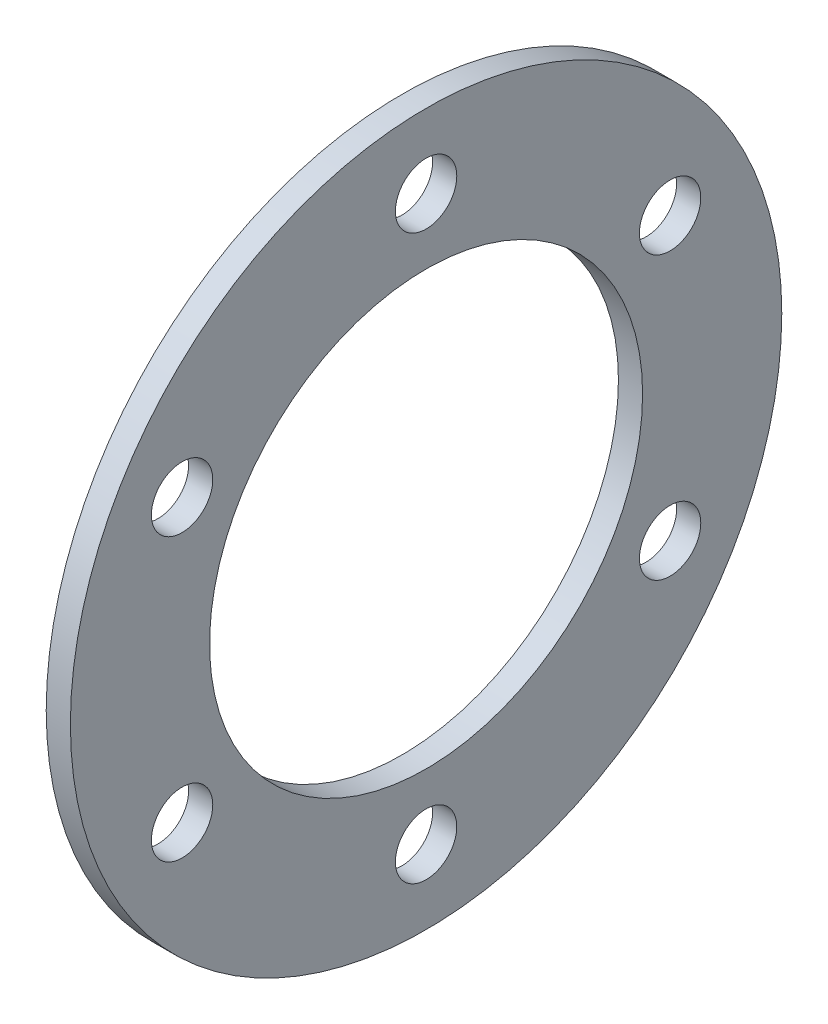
from build123d import *

# Parameters (mm, degrees)
SKETCH1_R           = 46
SKETCH1_R_2         = 28
BOSS_EXTRUDE1_DEPTH = 3.125
SKETCH2_R           = 3.96875
CUT_EXTRUDE1_DEPTH  = 66.128838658
CIRPATTERN1_COUNT   = 6


with BuildPart() as part:
    # Sketch1 → Boss-Extrude1 (new body)
    with BuildSketch(Plane(origin=(0, 0, 0), x_dir=(0, 0, -1), z_dir=(1, 0, 0))):
        Circle(SKETCH1_R)
        Circle(SKETCH1_R_2, mode=Mode.SUBTRACT)
    extrude(amount=BOSS_EXTRUDE1_DEPTH)

    # Sketch2 → Cut-Extrude1 (cut, through all)
    with BuildSketch(Plane(origin=(3.125, 0, 0), x_dir=(0, 0, -1), z_dir=(1, 0, 0))):
        with Locations((0, 36.4353125)):
            Circle(SKETCH2_R)
    cut_extrude1 = extrude(amount=-CUT_EXTRUDE1_DEPTH, mode=Mode.SUBTRACT)

    # CirPattern1: Cut-Extrude1 ×6 about axis
    cirpattern1_axis = Axis((0, 0, 0), (1, 0, 0))
    for i in range(1, CIRPATTERN1_COUNT):
        add(cut_extrude1.rotate(cirpattern1_axis, i * 360 / CIRPATTERN1_COUNT), mode=Mode.SUBTRACT)


solid = part.part
